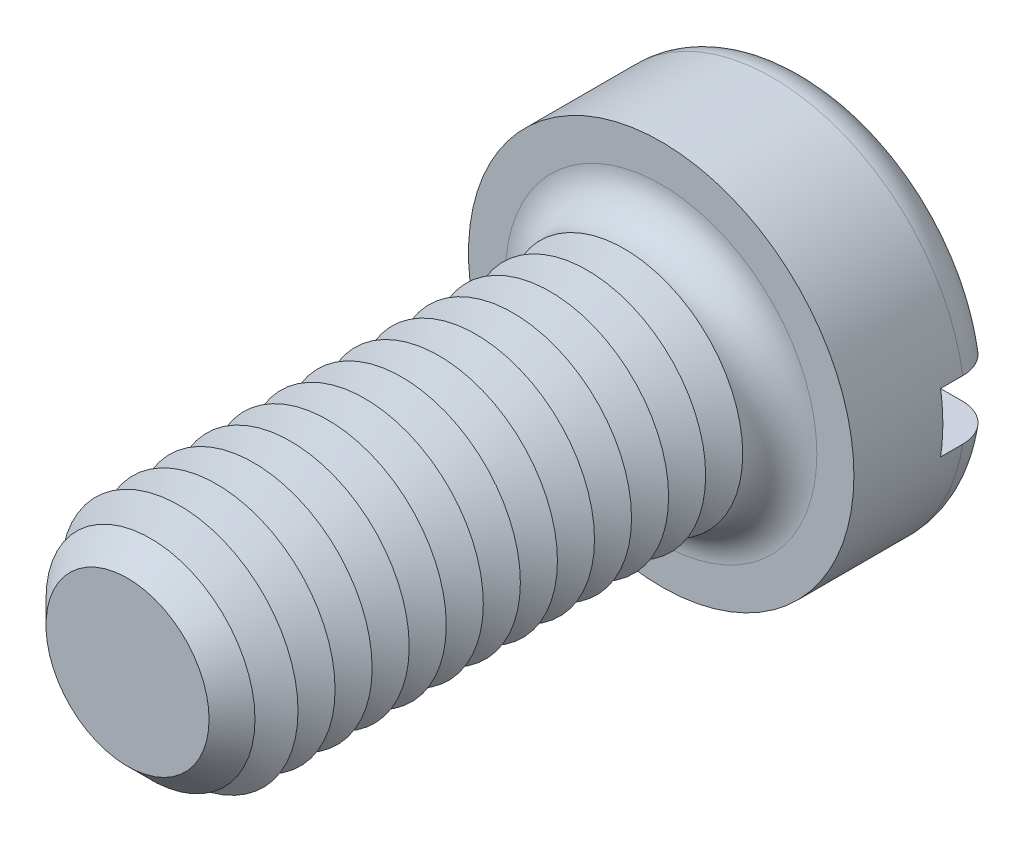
ISO-10303-21;
HEADER;
FILE_DESCRIPTION(('STEP AP214'),'2;1');
FILE_NAME('part.step','',(''),(''),'','','');
FILE_SCHEMA(('AUTOMOTIVE_DESIGN { 1 0 10303 214 1 1 1 1 }'));
ENDSEC;
DATA;
#1=APPLICATION_CONTEXT('core data for automotive mechanical design processes');
#2=APPLICATION_PROTOCOL_DEFINITION('international standard','automotive_design',2000,#1);
#3=PRODUCT_CONTEXT('',#1,'mechanical');
#4=PRODUCT('Part','Part','',(#3));
#5=PRODUCT_RELATED_PRODUCT_CATEGORY('part','',(#4));
#6=PRODUCT_DEFINITION_FORMATION('','',#4);
#7=PRODUCT_DEFINITION_CONTEXT('part definition',#1,'design');
#8=PRODUCT_DEFINITION('design','',#6,#7);
#9=PRODUCT_DEFINITION_SHAPE('','',#8);
#10=(LENGTH_UNIT() NAMED_UNIT(*) SI_UNIT(.MILLI.,.METRE.));
#11=(NAMED_UNIT(*) PLANE_ANGLE_UNIT() SI_UNIT($,.RADIAN.));
#12=(NAMED_UNIT(*) SI_UNIT($,.STERADIAN.) SOLID_ANGLE_UNIT());
#13=UNCERTAINTY_MEASURE_WITH_UNIT(LENGTH_MEASURE(1.E-05),#10,'distance_accuracy_value','');
#14=(GEOMETRIC_REPRESENTATION_CONTEXT(3) GLOBAL_UNCERTAINTY_ASSIGNED_CONTEXT((#13)) GLOBAL_UNIT_ASSIGNED_CONTEXT((#10,
#11,#12)) REPRESENTATION_CONTEXT('',''));
#15=CARTESIAN_POINT('',(0.,0.,0.));
#16=DIRECTION('',(0.,0.,1.));
#17=DIRECTION('',(1.,0.,0.));
#18=AXIS2_PLACEMENT_3D('',#15,#16,#17);
#19=CARTESIAN_POINT('',(0.,0.,-5.));
#20=DIRECTION('',(0.,0.,1.));
#21=DIRECTION('',(1.,0.,0.));
#22=AXIS2_PLACEMENT_3D('',#19,#20,#21);
#23=PLANE('',#22);
#24=CARTESIAN_POINT('',(0.,0.,-5.));
#25=DIRECTION('',(0.,0.,1.));
#26=DIRECTION('',(1.,0.,0.));
#27=AXIS2_PLACEMENT_3D('',#24,#25,#26);
#28=CIRCLE('',#27,5.25);
#29=CARTESIAN_POINT('',(-5.15388203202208,1.,-5.));
#30=VERTEX_POINT('',#29);
#31=CARTESIAN_POINT('',(5.15388203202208,1.,-5.));
#32=VERTEX_POINT('',#31);
#33=EDGE_CURVE('E116',#30,#32,#28,.F.);
#34=ORIENTED_EDGE('',*,*,#33,.T.);
#35=DIRECTION('',(1.,0.,0.));
#36=VECTOR('',#35,1.);
#37=CARTESIAN_POINT('',(-6.5,1.,-5.));
#38=LINE('',#37,#36);
#39=EDGE_CURVE('E111',#30,#32,#38,.T.);
#40=ORIENTED_EDGE('',*,*,#39,.F.);
#41=EDGE_LOOP('',(#34,#40));
#42=FACE_BOUND('',#41,.T.);
#43=ADVANCED_FACE('F39',(#42),#23,.F.);
#44=CARTESIAN_POINT('',(0.,0.,-3.75));
#45=DIRECTION('',(0.,0.,1.));
#46=DIRECTION('',(1.,0.,0.));
#47=AXIS2_PLACEMENT_3D('',#44,#45,#46);
#48=TOROIDAL_SURFACE('',#47,5.25,1.25);
#49=CARTESIAN_POINT('',(-6.04655789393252,1.,-4.63904490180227));
#50=CARTESIAN_POINT('',(-5.99546860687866,1.,-4.68885774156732));
#51=CARTESIAN_POINT('',(-5.94008472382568,1.,-4.73434760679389));
#52=CARTESIAN_POINT('',(-5.8223927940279,1.,-4.81538052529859));
#53=CARTESIAN_POINT('',(-5.7600753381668,1.,-4.85090982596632));
#54=CARTESIAN_POINT('',(-5.63044351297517,1.,-4.91100606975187));
#55=CARTESIAN_POINT('',(-5.56313479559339,1.,-4.93558519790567));
#56=CARTESIAN_POINT('',(-5.42539577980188,1.,-4.97322457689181));
#57=CARTESIAN_POINT('',(-5.35496625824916,1.,-4.98628767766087));
#58=CARTESIAN_POINT('',(-5.21212635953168,1.,-5.00070478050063));
#59=CARTESIAN_POINT('',(-5.13970265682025,1.,-5.00192674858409));
#60=CARTESIAN_POINT('',(-4.99565121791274,1.,-4.99234085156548));
#61=CARTESIAN_POINT('',(-4.92402357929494,1.,-4.98153152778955));
#62=CARTESIAN_POINT('',(-4.78274786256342,1.,-4.94801424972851));
#63=CARTESIAN_POINT('',(-4.71313137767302,1.,-4.92517296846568));
#64=CARTESIAN_POINT('',(-4.57871041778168,1.,-4.86813760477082));
#65=CARTESIAN_POINT('',(-4.51390612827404,1.,-4.83394308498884));
#66=CARTESIAN_POINT('',(-4.39095493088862,1.,-4.75508341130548));
#67=CARTESIAN_POINT('',(-4.33281197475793,1.,-4.7104120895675));
#68=CARTESIAN_POINT('',(-4.22499800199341,1.,-4.61179869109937));
#69=CARTESIAN_POINT('',(-4.17532640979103,1.,-4.55785724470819));
#70=CARTESIAN_POINT('',(-4.08677450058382,1.,-4.4431082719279));
#71=CARTESIAN_POINT('',(-4.0477350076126,1.,-4.38242369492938));
#72=CARTESIAN_POINT('',(-3.98074296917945,1.,-4.25521412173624));
#73=CARTESIAN_POINT('',(-3.95278836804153,1.,-4.18869021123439));
#74=CARTESIAN_POINT('',(-3.90959497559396,1.,-4.0537026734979));
#75=CARTESIAN_POINT('',(-3.89401985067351,1.,-3.98534663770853));
#76=CARTESIAN_POINT('',(-3.8748586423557,1.,-3.84697740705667));
#77=CARTESIAN_POINT('',(-3.87127067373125,1.,-3.7769644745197));
#78=CARTESIAN_POINT('',(-3.8761573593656,1.,-3.63892215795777));
#79=CARTESIAN_POINT('',(-3.88436651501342,1.,-3.57088319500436));
#80=CARTESIAN_POINT('',(-3.91207743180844,1.,-3.43714958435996));
#81=CARTESIAN_POINT('',(-3.93157911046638,1.,-3.37145491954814));
#82=CARTESIAN_POINT('',(-3.98125045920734,1.,-3.24411474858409));
#83=CARTESIAN_POINT('',(-4.01143761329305,1.,-3.18247607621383));
#84=CARTESIAN_POINT('',(-4.08150210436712,1.,-3.064981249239));
#85=CARTESIAN_POINT('',(-4.12138048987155,1.,-3.0091257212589));
#86=CARTESIAN_POINT('',(-4.2106718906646,1.,-2.90336353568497));
#87=CARTESIAN_POINT('',(-4.26028693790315,1.,-2.85362751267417));
#88=CARTESIAN_POINT('',(-4.36696587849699,1.,-2.76291710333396));
#89=CARTESIAN_POINT('',(-4.42403082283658,1.,-2.72194395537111));
#90=CARTESIAN_POINT('',(-4.54567957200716,1.,-2.64877280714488));
#91=CARTESIAN_POINT('',(-4.61042643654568,1.,-2.61684571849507));
#92=CARTESIAN_POINT('',(-4.74430563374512,1.,-2.56412359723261));
#93=CARTESIAN_POINT('',(-4.81343838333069,1.,-2.54332962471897));
#94=CARTESIAN_POINT('',(-4.95527237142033,1.,-2.51320471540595));
#95=CARTESIAN_POINT('',(-5.0280120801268,1.,-2.50405449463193));
#96=CARTESIAN_POINT('',(-5.17399775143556,1.,-2.49810126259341));
#97=CARTESIAN_POINT('',(-5.24724372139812,1.,-2.50129843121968));
#98=CARTESIAN_POINT('',(-5.3921014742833,1.,-2.52000776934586));
#99=CARTESIAN_POINT('',(-5.4637142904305,1.,-2.53551191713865));
#100=CARTESIAN_POINT('',(-5.60326680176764,1.,-2.57846304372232));
#101=CARTESIAN_POINT('',(-5.67120668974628,1.,-2.60590939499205));
#102=CARTESIAN_POINT('',(-5.80064060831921,1.,-2.67164926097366));
#103=CARTESIAN_POINT('',(-5.862199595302,1.,-2.7098148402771));
#104=CARTESIAN_POINT('',(-5.9779079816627,1.,-2.79608690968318));
#105=CARTESIAN_POINT('',(-6.03205795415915,1.,-2.84419263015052));
#106=CARTESIAN_POINT('',(-6.13055119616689,1.,-2.94820522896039));
#107=CARTESIAN_POINT('',(-6.17502887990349,1.,-3.00398483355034));
#108=CARTESIAN_POINT('',(-6.25384180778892,1.,-3.12230113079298));
#109=CARTESIAN_POINT('',(-6.28817779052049,1.,-3.18483733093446));
#110=CARTESIAN_POINT('',(-6.34527986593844,1.,-3.31401726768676));
#111=CARTESIAN_POINT('',(-6.36818984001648,1.,-3.38059742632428));
#112=CARTESIAN_POINT('',(-6.40240470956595,1.,-3.5166725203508));
#113=CARTESIAN_POINT('',(-6.41371067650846,1.,-3.58616718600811));
#114=CARTESIAN_POINT('',(-6.42433240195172,1.,-3.72550026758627));
#115=CARTESIAN_POINT('',(-6.4237441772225,1.,-3.79533138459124));
#116=CARTESIAN_POINT('',(-6.41082814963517,1.,-3.93391789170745));
#117=CARTESIAN_POINT('',(-6.39849757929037,1.,-4.00267302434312));
#118=CARTESIAN_POINT('',(-6.36249191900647,1.,-4.13704597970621));
#119=CARTESIAN_POINT('',(-6.33883072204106,1.,-4.20266753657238));
#120=CARTESIAN_POINT('',(-6.28088769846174,1.,-4.32897165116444));
#121=CARTESIAN_POINT('',(-6.24661890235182,1.,-4.38966015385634));
#122=CARTESIAN_POINT('',(-6.18404039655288,1.,-4.48163773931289));
#123=CARTESIAN_POINT('',(-6.15876600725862,1.,-4.51503333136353));
#124=CARTESIAN_POINT('',(-6.10500607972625,1.,-4.5791298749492));
#125=CARTESIAN_POINT('',(-6.07652056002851,1.,-4.60983084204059));
#126=CARTESIAN_POINT('',(-6.04655789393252,1.,-4.63904490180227));
#127=B_SPLINE_CURVE_WITH_KNOTS('',3,(#49,#50,#51,#52,#53,#54,#55,#56,#57,#58,#59,#60,#61,#62,
#63,#64,#65,#66,#67,#68,#69,#70,#71,#72,#73,#74,#75,#76,#77,#78,#79,#80,#81,#82,#83,#84,#85,#86,
#87,#88,#89,#90,#91,#92,#93,#94,#95,#96,#97,#98,#99,#100,#101,#102,#103,#104,#105,#106,#107,
#108,#109,#110,#111,#112,#113,#114,#115,#116,#117,#118,#119,#120,#121,#122,#123,#124,#125,#126),
.UNSPECIFIED.,.T.,.F.,(4,2,2,2,2,2,2,2,2,2,2,2,2,2,2,2,2,2,2,2,2,2,2,2,2,2,2,2,2,2,2,2,2,2,2,2,
2,2,4),(0.,0.213907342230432,0.428108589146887,0.642070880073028,0.855980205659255,
1.07227200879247,1.28859003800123,1.50735715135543,1.72613269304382,1.94503735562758,
2.16392713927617,2.37933295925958,2.59469881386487,2.80399176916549,3.01325180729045,
3.2178754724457,3.42249764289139,3.62745618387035,3.83243690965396,4.04223444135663,
4.25206160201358,4.46763253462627,4.68322399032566,4.90212226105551,5.12102372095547,
5.33978261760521,5.55853002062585,5.77477015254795,5.99099354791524,6.20398686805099,
6.41696467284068,6.62718821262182,6.83739233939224,7.0459002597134,7.25445733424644,
7.46275934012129,7.67080647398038,7.79625882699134,7.92171045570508),.UNSPECIFIED.);
#128=CARTESIAN_POINT('',(-6.42261628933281,1.,-3.74999999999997));
#129=VERTEX_POINT('',#128);
#130=EDGE_CURVE('E288',#129,#30,#127,.T.);
#131=ORIENTED_EDGE('',*,*,#130,.F.);
#132=CARTESIAN_POINT('',(0.,0.,-3.75));
#133=DIRECTION('',(0.,0.,1.));
#134=DIRECTION('',(1.,0.,0.));
#135=AXIS2_PLACEMENT_3D('',#132,#133,#134);
#136=CIRCLE('',#135,6.5);
#137=CARTESIAN_POINT('',(6.42261628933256,1.,-3.75));
#138=VERTEX_POINT('',#137);
#139=EDGE_CURVE('E124',#138,#129,#136,.T.);
#140=ORIENTED_EDGE('',*,*,#139,.F.);
#141=CARTESIAN_POINT('',(4.06944999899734,1.,-4.4133199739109));
#142=CARTESIAN_POINT('',(4.10828271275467,1.,-4.47354709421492));
#143=CARTESIAN_POINT('',(4.15233880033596,1.,-4.53047894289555));
#144=CARTESIAN_POINT('',(4.24946916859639,1.,-4.63614530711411));
#145=CARTESIAN_POINT('',(4.3025574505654,1.,-4.68486685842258));
#146=CARTESIAN_POINT('',(4.41603250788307,1.,-4.77271114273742));
#147=CARTESIAN_POINT('',(4.47640839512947,1.,-4.8118479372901));
#148=CARTESIAN_POINT('',(4.60277035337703,1.,-4.87959878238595));
#149=CARTESIAN_POINT('',(4.66875480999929,1.,-4.90821584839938));
#150=CARTESIAN_POINT('',(4.80558589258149,1.,-4.95456537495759));
#151=CARTESIAN_POINT('',(4.87649196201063,1.,-4.97212253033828));
#152=CARTESIAN_POINT('',(5.02024710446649,1.,-4.99514979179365));
#153=CARTESIAN_POINT('',(5.09309636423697,1.,-5.00061873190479));
#154=CARTESIAN_POINT('',(5.23902872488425,1.,-4.99926689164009));
#155=CARTESIAN_POINT('',(5.31211131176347,1.,-4.99238812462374));
#156=CARTESIAN_POINT('',(5.45605806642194,1.,-4.96635140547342));
#157=CARTESIAN_POINT('',(5.52692231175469,1.,-4.94719388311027));
#158=CARTESIAN_POINT('',(5.66376170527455,1.,-4.89728421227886));
#159=CARTESIAN_POINT('',(5.72977335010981,1.,-4.86663219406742));
#160=CARTESIAN_POINT('',(5.85560715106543,1.,-4.79452334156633));
#161=CARTESIAN_POINT('',(5.91542977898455,1.,-4.7530673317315));
#162=CARTESIAN_POINT('',(6.02626022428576,1.,-4.66116821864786));
#163=CARTESIAN_POINT('',(6.07738307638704,1.,-4.6108638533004));
#164=CARTESIAN_POINT('',(6.17030947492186,1.,-4.50227823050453));
#165=CARTESIAN_POINT('',(6.2121137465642,1.,-4.44399759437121));
#166=CARTESIAN_POINT('',(6.28460268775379,1.,-4.32200305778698));
#167=CARTESIAN_POINT('',(6.31543589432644,1.,-4.2583773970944));
#168=CARTESIAN_POINT('',(6.36586009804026,1.,-4.12681721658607));
#169=CARTESIAN_POINT('',(6.38545178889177,1.,-4.0588829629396));
#170=CARTESIAN_POINT('',(6.41265760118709,1.,-3.92136007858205));
#171=CARTESIAN_POINT('',(6.42038873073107,1.,-3.85179457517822));
#172=CARTESIAN_POINT('',(6.42401070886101,1.,-3.7123569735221));
#173=CARTESIAN_POINT('',(6.41990193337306,1.,-3.64248488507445));
#174=CARTESIAN_POINT('',(6.40000894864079,1.,-3.50470871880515));
#175=CARTESIAN_POINT('',(6.38427119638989,1.,-3.43679792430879));
#176=CARTESIAN_POINT('',(6.34164491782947,1.,-3.30457296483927));
#177=CARTESIAN_POINT('',(6.31475638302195,1.,-3.24025880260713));
#178=CARTESIAN_POINT('',(6.2505455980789,1.,-3.11686791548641));
#179=CARTESIAN_POINT('',(6.21319759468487,1.,-3.05780459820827));
#180=CARTESIAN_POINT('',(6.12919411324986,1.,-2.94671919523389));
#181=CARTESIAN_POINT('',(6.08253833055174,1.,-2.89469734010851));
#182=CARTESIAN_POINT('',(5.98083387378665,1.,-2.79868150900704));
#183=CARTESIAN_POINT('',(5.92571704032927,1.,-2.75475975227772));
#184=CARTESIAN_POINT('',(5.80897194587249,1.,-2.67665277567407));
#185=CARTESIAN_POINT('',(5.74734329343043,1.,-2.64246814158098));
#186=CARTESIAN_POINT('',(5.6184644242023,1.,-2.58431810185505));
#187=CARTESIAN_POINT('',(5.55115102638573,1.,-2.56049275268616));
#188=CARTESIAN_POINT('',(5.41351272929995,1.,-2.52429868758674));
#189=CARTESIAN_POINT('',(5.34318759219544,1.,-2.51193087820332));
#190=CARTESIAN_POINT('',(5.20041507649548,1.,-2.49882112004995));
#191=CARTESIAN_POINT('',(5.12795169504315,1.,-2.49825332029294));
#192=CARTESIAN_POINT('',(4.98393373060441,1.,-2.50914771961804));
#193=CARTESIAN_POINT('',(4.91237921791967,1.,-2.52061084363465));
#194=CARTESIAN_POINT('',(4.77137358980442,1.,-2.55542281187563));
#195=CARTESIAN_POINT('',(4.70195472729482,1.,-2.57890245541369));
#196=CARTESIAN_POINT('',(4.56803538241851,1.,-2.63717701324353));
#197=CARTESIAN_POINT('',(4.50353509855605,1.,-2.67197238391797));
#198=CARTESIAN_POINT('',(4.38131858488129,1.,-2.7519648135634));
#199=CARTESIAN_POINT('',(4.32360365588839,1.,-2.79716386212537));
#200=CARTESIAN_POINT('',(4.21673400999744,1.,-2.89675634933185));
#201=CARTESIAN_POINT('',(4.16757871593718,1.,-2.95114916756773));
#202=CARTESIAN_POINT('',(4.08014713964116,1.,-3.06667703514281));
#203=CARTESIAN_POINT('',(4.04170608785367,1.,-3.12768727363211));
#204=CARTESIAN_POINT('',(3.97596192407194,1.,-3.25543782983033));
#205=CARTESIAN_POINT('',(3.94865624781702,1.,-3.32217682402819));
#206=CARTESIAN_POINT('',(3.9067737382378,1.,-3.45745603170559));
#207=CARTESIAN_POINT('',(3.89185707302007,1.,-3.52589108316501));
#208=CARTESIAN_POINT('',(3.87400755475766,1.,-3.66432360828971));
#209=CARTESIAN_POINT('',(3.87107601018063,1.,-3.73432125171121));
#210=CARTESIAN_POINT('',(3.8772387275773,1.,-3.87228267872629));
#211=CARTESIAN_POINT('',(3.88607933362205,1.,-3.94025811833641));
#212=CARTESIAN_POINT('',(3.91502769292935,1.,-4.07370133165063));
#213=CARTESIAN_POINT('',(3.93512131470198,1.,-4.1391721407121));
#214=CARTESIAN_POINT('',(3.9752037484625,1.,-4.23926719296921));
#215=CARTESIAN_POINT('',(3.99171171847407,1.,-4.27532618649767));
#216=CARTESIAN_POINT('',(4.02809737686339,1.,-4.34569933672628));
#217=CARTESIAN_POINT('',(4.04797497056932,1.,-4.3800135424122));
#218=CARTESIAN_POINT('',(4.06944999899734,1.,-4.4133199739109));
#219=B_SPLINE_CURVE_WITH_KNOTS('',3,(#141,#142,#143,#144,#145,#146,#147,#148,#149,#150,#151,
#152,#153,#154,#155,#156,#157,#158,#159,#160,#161,#162,#163,#164,#165,#166,#167,#168,#169,#170,
#171,#172,#173,#174,#175,#176,#177,#178,#179,#180,#181,#182,#183,#184,#185,#186,#187,#188,#189,
#190,#191,#192,#193,#194,#195,#196,#197,#198,#199,#200,#201,#202,#203,#204,#205,#206,#207,#208,
#209,#210,#211,#212,#213,#214,#215,#216,#217,#218),.UNSPECIFIED.,.T.,.F.,(4,2,2,2,2,2,2,2,2,2,2,
2,2,2,2,2,2,2,2,2,2,2,2,2,2,2,2,2,2,2,2,2,2,2,2,2,2,2,4),(0.,0.214833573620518,
0.430003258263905,0.644855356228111,0.859645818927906,1.0777603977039,1.29589601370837,
1.51505870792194,1.73421373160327,1.95150241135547,2.16877451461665,2.38290237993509,
2.59701357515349,2.8081044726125,3.01918234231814,3.22816416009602,3.43713934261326,
3.64528416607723,3.85342914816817,4.06209119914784,4.27076008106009,4.48120788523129,
4.69166834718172,4.90489186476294,5.11813225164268,5.33451752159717,5.55091942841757,
5.76972860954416,5.98854661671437,6.20740650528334,6.42625163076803,6.64151774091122,
6.85673425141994,7.0658317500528,7.27495207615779,7.47963858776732,7.68406862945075,
7.80287790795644,7.92168384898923),.UNSPECIFIED.);
#220=EDGE_CURVE('E290',#32,#138,#219,.T.);
#221=ORIENTED_EDGE('',*,*,#220,.F.);
#222=ORIENTED_EDGE('',*,*,#33,.F.);
#223=EDGE_LOOP('',(#131,#140,#221,#222));
#224=FACE_BOUND('',#223,.T.);
#225=ADVANCED_FACE('F272',(#224),#48,.T.);
#226=CARTESIAN_POINT('',(0.,0.,-5.));
#227=DIRECTION('',(0.,0.,1.));
#228=DIRECTION('',(1.,0.,0.));
#229=AXIS2_PLACEMENT_3D('',#226,#227,#228);
#230=CYLINDRICAL_SURFACE('',#229,6.5);
#231=DIRECTION('',(0.,0.,1.));
#232=VECTOR('',#231,1.);
#233=CARTESIAN_POINT('',(6.42261628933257,1.,-5.));
#234=LINE('',#233,#232);
#235=CARTESIAN_POINT('',(6.42261628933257,1.,-3.));
#236=VERTEX_POINT('',#235);
#237=EDGE_CURVE('E306',#138,#236,#234,.T.);
#238=ORIENTED_EDGE('',*,*,#237,.F.);
#239=ORIENTED_EDGE('',*,*,#139,.T.);
#240=DIRECTION('',(0.,0.,1.));
#241=VECTOR('',#240,1.);
#242=CARTESIAN_POINT('',(-6.42261628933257,1.,-5.));
#243=LINE('',#242,#241);
#244=CARTESIAN_POINT('',(-6.42261628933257,1.,-3.));
#245=VERTEX_POINT('',#244);
#246=EDGE_CURVE('E63',#245,#129,#243,.F.);
#247=ORIENTED_EDGE('',*,*,#246,.F.);
#248=CARTESIAN_POINT('',(0.,0.,-3.));
#249=DIRECTION('',(0.,0.,-1.));
#250=DIRECTION('',(-1.,0.,0.));
#251=AXIS2_PLACEMENT_3D('',#248,#249,#250);
#252=CIRCLE('',#251,6.5);
#253=CARTESIAN_POINT('',(-6.42261628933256,-0.999999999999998,-3.));
#254=VERTEX_POINT('',#253);
#255=EDGE_CURVE('E43',#245,#254,#252,.F.);
#256=ORIENTED_EDGE('',*,*,#255,.T.);
#257=DIRECTION('',(0.,0.,1.));
#258=VECTOR('',#257,1.);
#259=CARTESIAN_POINT('',(-6.42261628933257,-0.999999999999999,-5.));
#260=LINE('',#259,#258);
#261=CARTESIAN_POINT('',(-6.42261628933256,-0.999999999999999,-3.75));
#262=VERTEX_POINT('',#261);
#263=EDGE_CURVE('E303',#262,#254,#260,.T.);
#264=ORIENTED_EDGE('',*,*,#263,.F.);
#265=CARTESIAN_POINT('',(6.42261628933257,-1.,-3.75));
#266=VERTEX_POINT('',#265);
#267=EDGE_CURVE('E126',#262,#266,#136,.T.);
#268=ORIENTED_EDGE('',*,*,#267,.T.);
#269=DIRECTION('',(0.,0.,1.));
#270=VECTOR('',#269,1.);
#271=CARTESIAN_POINT('',(6.42261628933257,-1.,-5.));
#272=LINE('',#271,#270);
#273=CARTESIAN_POINT('',(6.42261628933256,-1.,-3.));
#274=VERTEX_POINT('',#273);
#275=EDGE_CURVE('E55',#274,#266,#272,.F.);
#276=ORIENTED_EDGE('',*,*,#275,.F.);
#277=EDGE_CURVE('E11',#274,#236,#252,.F.);
#278=ORIENTED_EDGE('',*,*,#277,.T.);
#279=EDGE_LOOP('',(#238,#239,#247,#256,#264,#268,#276,#278));
#280=FACE_BOUND('',#279,.T.);
#281=CARTESIAN_POINT('',(0.,0.,0.));
#282=DIRECTION('',(0.,0.,1.));
#283=DIRECTION('',(1.,0.,0.));
#284=AXIS2_PLACEMENT_3D('',#281,#282,#283);
#285=CIRCLE('',#284,6.5);
#286=CARTESIAN_POINT('',(6.5,0.,0.));
#287=VERTEX_POINT('',#286);
#288=EDGE_CURVE('E309',#287,#287,#285,.T.);
#289=ORIENTED_EDGE('',*,*,#288,.F.);
#290=EDGE_LOOP('',(#289));
#291=FACE_BOUND('',#290,.T.);
#292=ADVANCED_FACE('F268',(#280,#291),#230,.T.);
#293=CARTESIAN_POINT('',(5.15388203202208,-1.,-5.));
#294=VERTEX_POINT('',#293);
#295=CARTESIAN_POINT('',(-5.15388203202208,-0.999999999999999,-5.));
#296=VERTEX_POINT('',#295);
#297=EDGE_CURVE('E109',#294,#296,#28,.F.);
#298=ORIENTED_EDGE('',*,*,#297,.T.);
#299=DIRECTION('',(-1.,0.,0.));
#300=VECTOR('',#299,1.);
#301=CARTESIAN_POINT('',(-6.5,-0.999999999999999,-5.));
#302=LINE('',#301,#300);
#303=EDGE_CURVE('E96',#294,#296,#302,.T.);
#304=ORIENTED_EDGE('',*,*,#303,.F.);
#305=EDGE_LOOP('',(#298,#304));
#306=FACE_BOUND('',#305,.T.);
#307=ADVANCED_FACE('F108',(#306),#23,.F.);
#308=CARTESIAN_POINT('',(0.,0.,0.));
#309=DIRECTION('',(0.,0.,1.));
#310=DIRECTION('',(1.,0.,0.));
#311=AXIS2_PLACEMENT_3D('',#308,#309,#310);
#312=PLANE('',#311);
#313=CARTESIAN_POINT('',(0.,0.,0.));
#314=DIRECTION('',(0.,0.,1.));
#315=DIRECTION('',(1.,0.,0.));
#316=AXIS2_PLACEMENT_3D('',#313,#314,#315);
#317=CIRCLE('',#316,5.25);
#318=CARTESIAN_POINT('',(5.25,0.,0.));
#319=VERTEX_POINT('',#318);
#320=EDGE_CURVE('E115',#319,#319,#317,.F.);
#321=ORIENTED_EDGE('',*,*,#320,.T.);
#322=EDGE_LOOP('',(#321));
#323=FACE_BOUND('',#322,.T.);
#324=ORIENTED_EDGE('',*,*,#288,.T.);
#325=EDGE_LOOP('',(#324));
#326=FACE_BOUND('',#325,.T.);
#327=ADVANCED_FACE('F267',(#323,#326),#312,.T.);
#328=CARTESIAN_POINT('',(-6.04655789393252,-0.999999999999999,-4.63904490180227));
#329=CARTESIAN_POINT('',(-6.0966604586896,-0.999999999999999,-4.59018532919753));
#330=CARTESIAN_POINT('',(-6.14270501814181,-0.999999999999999,-4.53709744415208));
#331=CARTESIAN_POINT('',(-6.22528519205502,-0.999999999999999,-4.42391631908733));
#332=CARTESIAN_POINT('',(-6.26181074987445,-0.999999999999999,-4.36381576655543));
#333=CARTESIAN_POINT('',(-6.32422109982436,-0.999999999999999,-4.23831836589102));
#334=CARTESIAN_POINT('',(-6.35010658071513,-0.999999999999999,-4.17292186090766));
#335=CARTESIAN_POINT('',(-6.39044668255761,-0.999999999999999,-4.03870925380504));
#336=CARTESIAN_POINT('',(-6.40490396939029,-0.999999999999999,-3.96989395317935));
#337=CARTESIAN_POINT('',(-6.42190814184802,-0.999999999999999,-3.83122595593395));
#338=CARTESIAN_POINT('',(-6.4245257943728,-0.999999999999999,-3.76138193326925));
#339=CARTESIAN_POINT('',(-6.41796432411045,-0.999999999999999,-3.62224935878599));
#340=CARTESIAN_POINT('',(-6.40878509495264,-0.999999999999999,-3.55296081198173));
#341=CARTESIAN_POINT('',(-6.37894560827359,-0.999999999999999,-3.41709241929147));
#342=CARTESIAN_POINT('',(-6.35831520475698,-0.999999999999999,-3.35050601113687));
#343=CARTESIAN_POINT('',(-6.30620980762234,-0.999999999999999,-3.22172312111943));
#344=CARTESIAN_POINT('',(-6.2747347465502,-0.999999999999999,-3.15952666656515));
#345=CARTESIAN_POINT('',(-6.20172710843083,-0.999999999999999,-3.04101762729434));
#346=CARTESIAN_POINT('',(-6.16015622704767,-0.999999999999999,-2.98472864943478));
#347=CARTESIAN_POINT('',(-6.06823774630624,-0.999999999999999,-2.87984578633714));
#348=CARTESIAN_POINT('',(-6.01788981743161,-0.999999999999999,-2.83125219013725));
#349=CARTESIAN_POINT('',(-5.90933830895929,-0.999999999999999,-2.74262118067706));
#350=CARTESIAN_POINT('',(-5.85106338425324,-0.999999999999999,-2.70267117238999));
#351=CARTESIAN_POINT('',(-5.72870702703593,-0.999999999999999,-2.63296796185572));
#352=CARTESIAN_POINT('',(-5.66462521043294,-0.999999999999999,-2.6032154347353));
#353=CARTESIAN_POINT('',(-5.53153273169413,-0.999999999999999,-2.55430842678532));
#354=CARTESIAN_POINT('',(-5.46246626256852,-0.999999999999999,-2.53530583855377));
#355=CARTESIAN_POINT('',(-5.32214267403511,-0.999999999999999,-2.5089831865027));
#356=CARTESIAN_POINT('',(-5.25088537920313,-0.999999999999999,-2.50166406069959));
#357=CARTESIAN_POINT('',(-5.10710123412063,-0.999999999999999,-2.49882202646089));
#358=CARTESIAN_POINT('',(-5.03457095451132,-0.999999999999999,-2.50347166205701));
#359=CARTESIAN_POINT('',(-4.8912897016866,-0.999999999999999,-2.52476029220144));
#360=CARTESIAN_POINT('',(-4.82053886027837,-0.999999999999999,-2.54140017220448));
#361=CARTESIAN_POINT('',(-4.68213257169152,-0.999999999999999,-2.58641614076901));
#362=CARTESIAN_POINT('',(-4.61451256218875,-0.999999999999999,-2.61490131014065));
#363=CARTESIAN_POINT('',(-4.48502801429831,-0.999999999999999,-2.68285095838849));
#364=CARTESIAN_POINT('',(-4.42316359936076,-0.999999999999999,-2.72231567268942));
#365=CARTESIAN_POINT('',(-4.30720694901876,-0.999999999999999,-2.81103994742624));
#366=CARTESIAN_POINT('',(-4.25309118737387,-0.999999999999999,-2.86026872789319));
#367=CARTESIAN_POINT('',(-4.15409408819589,-0.999999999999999,-2.9672764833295));
#368=CARTESIAN_POINT('',(-4.10921182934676,-0.999999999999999,-3.02505460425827));
#369=CARTESIAN_POINT('',(-4.03096584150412,-0.999999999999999,-3.14632492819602));
#370=CARTESIAN_POINT('',(-3.99739097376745,-0.999999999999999,-3.2096807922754));
#371=CARTESIAN_POINT('',(-3.94171839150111,-0.999999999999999,-3.34124912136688));
#372=CARTESIAN_POINT('',(-3.91961840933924,-0.999999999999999,-3.40946062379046));
#373=CARTESIAN_POINT('',(-3.88816636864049,-0.999999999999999,-3.54669256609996));
#374=CARTESIAN_POINT('',(-3.87846562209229,-0.999999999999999,-3.61563318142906));
#375=CARTESIAN_POINT('',(-3.87100568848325,-0.999999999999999,-3.75415397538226));
#376=CARTESIAN_POINT('',(-3.87324501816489,-0.999999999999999,-3.82373407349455));
#377=CARTESIAN_POINT('',(-3.88943589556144,-0.999999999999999,-3.96027701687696));
#378=CARTESIAN_POINT('',(-3.90318225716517,-0.999999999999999,-4.0272643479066));
#379=CARTESIAN_POINT('',(-3.94163954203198,-0.999999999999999,-4.1580093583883));
#380=CARTESIAN_POINT('',(-3.96635075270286,-0.999999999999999,-4.22176695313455));
#381=CARTESIAN_POINT('',(-4.026160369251,-0.999999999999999,-4.34483320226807));
#382=CARTESIAN_POINT('',(-4.06134035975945,-0.999999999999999,-4.40410214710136));
#383=CARTESIAN_POINT('',(-4.14090865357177,-0.999999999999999,-4.51609417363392));
#384=CARTESIAN_POINT('',(-4.18529811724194,-0.999999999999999,-4.56881642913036));
#385=CARTESIAN_POINT('',(-4.2832649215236,-0.999999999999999,-4.66770177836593));
#386=CARTESIAN_POINT('',(-4.33705327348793,-0.999999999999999,-4.71365579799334));
#387=CARTESIAN_POINT('',(-4.45141776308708,-0.999999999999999,-4.79615385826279));
#388=CARTESIAN_POINT('',(-4.51199483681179,-0.999999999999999,-4.83269659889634));
#389=CARTESIAN_POINT('',(-4.63989216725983,-0.999999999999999,-4.89626962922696));
#390=CARTESIAN_POINT('',(-4.70734508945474,-0.999999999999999,-4.92303326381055));
#391=CARTESIAN_POINT('',(-4.84575497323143,-0.999999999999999,-4.96500199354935));
#392=CARTESIAN_POINT('',(-4.91671207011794,-0.999999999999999,-4.98020664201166));
#393=CARTESIAN_POINT('',(-5.06097761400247,-0.999999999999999,-4.9987306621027));
#394=CARTESIAN_POINT('',(-5.13430353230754,-0.999999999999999,-5.00191441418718));
#395=CARTESIAN_POINT('',(-5.28046546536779,-0.999999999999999,-4.99587686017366));
#396=CARTESIAN_POINT('',(-5.35330135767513,-0.999999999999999,-4.98665256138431));
#397=CARTESIAN_POINT('',(-5.49610354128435,-0.999999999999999,-4.95604184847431));
#398=CARTESIAN_POINT('',(-5.56607890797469,-0.999999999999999,-4.93469772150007));
#399=CARTESIAN_POINT('',(-5.70131538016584,-0.999999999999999,-4.88041956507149));
#400=CARTESIAN_POINT('',(-5.76658233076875,-0.999999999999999,-4.84750021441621));
#401=CARTESIAN_POINT('',(-5.86782577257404,-0.999999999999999,-4.78498748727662));
#402=CARTESIAN_POINT('',(-5.90579749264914,-0.999999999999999,-4.75856648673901));
#403=CARTESIAN_POINT('',(-5.97862186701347,-0.999999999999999,-4.70172646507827));
#404=CARTESIAN_POINT('',(-6.0134745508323,-0.999999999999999,-4.6713074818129));
#405=CARTESIAN_POINT('',(-6.04655789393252,-0.999999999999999,-4.63904490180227));
#406=B_SPLINE_CURVE_WITH_KNOTS('',3,(#328,#329,#330,#331,#332,#333,#334,#335,#336,#337,#338,
#339,#340,#341,#342,#343,#344,#345,#346,#347,#348,#349,#350,#351,#352,#353,#354,#355,#356,#357,
#358,#359,#360,#361,#362,#363,#364,#365,#366,#367,#368,#369,#370,#371,#372,#373,#374,#375,#376,
#377,#378,#379,#380,#381,#382,#383,#384,#385,#386,#387,#388,#389,#390,#391,#392,#393,#394,#395,
#396,#397,#398,#399,#400,#401,#402,#403,#404,#405),.UNSPECIFIED.,.T.,.F.,(4,2,2,2,2,2,2,2,2,2,2,
2,2,2,2,2,2,2,2,2,2,2,2,2,2,2,2,2,2,2,2,2,2,2,2,2,2,2,4),(0.,0.209780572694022,
0.419781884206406,0.629769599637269,0.839708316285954,1.04839053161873,1.2570746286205,
1.46521720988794,1.67336108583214,1.88230736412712,2.09126148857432,2.30223890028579,
2.51323027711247,2.72713284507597,2.94105258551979,3.15807345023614,3.37511034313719,
3.59419176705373,3.81327788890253,4.03168404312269,4.25006839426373,4.46411376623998,
4.67811682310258,4.88595885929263,5.09377507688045,5.29796268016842,5.50215563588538,
5.70798353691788,5.91383738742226,6.12510741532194,6.33640661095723,6.55309998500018,
6.76980173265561,6.98894112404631,7.20813337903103,7.42656551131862,7.64472163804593,
7.78324365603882,7.92176436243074),.UNSPECIFIED.);
#407=EDGE_CURVE('E103',#296,#262,#406,.T.);
#408=ORIENTED_EDGE('',*,*,#407,.F.);
#409=ORIENTED_EDGE('',*,*,#297,.F.);
#410=CARTESIAN_POINT('',(4.06944999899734,-1.,-4.4133199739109));
#411=CARTESIAN_POINT('',(4.03213207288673,-1.,-4.3554312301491));
#412=CARTESIAN_POINT('',(3.9995849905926,-1.,-4.29441722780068));
#413=CARTESIAN_POINT('',(3.94511822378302,-1.,-4.16776604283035));
#414=CARTESIAN_POINT('',(3.92320762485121,-1.,-4.10212496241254));
#415=CARTESIAN_POINT('',(3.89078811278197,-1.,-3.96804412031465));
#416=CARTESIAN_POINT('',(3.88028409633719,-1.,-3.89960316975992));
#417=CARTESIAN_POINT('',(3.87107895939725,-1.,-3.76194650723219));
#418=CARTESIAN_POINT('',(3.87237511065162,-1.,-3.69273097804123));
#419=CARTESIAN_POINT('',(3.88662927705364,-1.,-3.55634460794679));
#420=CARTESIAN_POINT('',(3.89944923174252,-1.,-3.48915926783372));
#421=CARTESIAN_POINT('',(3.93611188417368,-1.,-3.35786953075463));
#422=CARTESIAN_POINT('',(3.95995518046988,-1.,-3.29376530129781));
#423=CARTESIAN_POINT('',(4.0180748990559,-1.,-3.16993562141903));
#424=CARTESIAN_POINT('',(4.05242297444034,-1.,-3.11024385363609));
#425=CARTESIAN_POINT('',(4.13041121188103,-1.,-2.9972793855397));
#426=CARTESIAN_POINT('',(4.17405248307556,-1.,-2.94400745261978));
#427=CARTESIAN_POINT('',(4.27058636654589,-1.,-2.8439150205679));
#428=CARTESIAN_POINT('',(4.32368948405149,-1.,-2.79729757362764));
#429=CARTESIAN_POINT('',(4.43679856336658,-1.,-2.71336600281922));
#430=CARTESIAN_POINT('',(4.49680546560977,-1.,-2.67605314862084));
#431=CARTESIAN_POINT('',(4.62370121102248,-1.,-2.61081752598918));
#432=CARTESIAN_POINT('',(4.69072799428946,-1.,-2.58316284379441));
#433=CARTESIAN_POINT('',(4.82843981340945,-1.,-2.5393441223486));
#434=CARTESIAN_POINT('',(4.899125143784,-1.,-2.52318100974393));
#435=CARTESIAN_POINT('',(5.04306377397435,-1.,-2.50267755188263));
#436=CARTESIAN_POINT('',(5.11633773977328,-1.,-2.49848181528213));
#437=CARTESIAN_POINT('',(5.26254809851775,-1.,-2.50249357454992));
#438=CARTESIAN_POINT('',(5.33548449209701,-1.,-2.51070104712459));
#439=CARTESIAN_POINT('',(5.4786703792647,-1.,-2.53930888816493));
#440=CARTESIAN_POINT('',(5.54892819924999,-1.,-2.5596675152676));
#441=CARTESIAN_POINT('',(5.68495799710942,-1.,-2.61204238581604));
#442=CARTESIAN_POINT('',(5.75073024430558,-1.,-2.64405792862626));
#443=CARTESIAN_POINT('',(5.8750178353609,-1.,-2.7184150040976));
#444=CARTESIAN_POINT('',(5.93361487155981,-1.,-2.76061995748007));
#445=CARTESIAN_POINT('',(6.04275377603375,-1.,-2.85440601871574));
#446=CARTESIAN_POINT('',(6.09329629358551,-1.,-2.90598637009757));
#447=CARTESIAN_POINT('',(6.18409572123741,-1.,-3.01622977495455));
#448=CARTESIAN_POINT('',(6.2244945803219,-1.,-3.07477592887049));
#449=CARTESIAN_POINT('',(6.29474798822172,-1.,-3.19788594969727));
#450=CARTESIAN_POINT('',(6.3246032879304,-1.,-3.26244938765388));
#451=CARTESIAN_POINT('',(6.37256001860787,-1.,-3.39491634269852));
#452=CARTESIAN_POINT('',(6.39079949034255,-1.,-3.46276990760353));
#453=CARTESIAN_POINT('',(6.41554133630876,-1.,-3.60058363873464));
#454=CARTESIAN_POINT('',(6.42204424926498,-1.,-3.67054370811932));
#455=CARTESIAN_POINT('',(6.42311237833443,-1.,-3.81007982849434));
#456=CARTESIAN_POINT('',(6.41775799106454,-1.,-3.879655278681));
#457=CARTESIAN_POINT('',(6.39543799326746,-1.,-4.01691664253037));
#458=CARTESIAN_POINT('',(6.3784725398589,-1.,-4.08460258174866));
#459=CARTESIAN_POINT('',(6.33344768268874,-1.,-4.21614537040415));
#460=CARTESIAN_POINT('',(6.30539273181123,-1.,-4.28000374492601));
#461=CARTESIAN_POINT('',(6.23902076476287,-1.,-4.40214140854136));
#462=CARTESIAN_POINT('',(6.20070356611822,-1.,-4.46042059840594));
#463=CARTESIAN_POINT('',(6.11467174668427,-1.,-4.5701315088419));
#464=CARTESIAN_POINT('',(6.06690270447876,-1.,-4.62152053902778));
#465=CARTESIAN_POINT('',(5.96350111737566,-1.,-4.715657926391));
#466=CARTESIAN_POINT('',(5.90786817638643,-1.,-4.75840584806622));
#467=CARTESIAN_POINT('',(5.78965380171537,-1.,-4.8345781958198));
#468=CARTESIAN_POINT('',(5.72700078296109,-1.,-4.86789149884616));
#469=CARTESIAN_POINT('',(5.59704977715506,-1.,-4.92369754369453));
#470=CARTESIAN_POINT('',(5.52975144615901,-1.,-4.94618948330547));
#471=CARTESIAN_POINT('',(5.39137621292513,-1.,-4.98006173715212));
#472=CARTESIAN_POINT('',(5.32025859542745,-1.,-4.99127571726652));
#473=CARTESIAN_POINT('',(5.17715081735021,-1.,-5.00177798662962));
#474=CARTESIAN_POINT('',(5.10516061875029,-1.,-5.00106575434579));
#475=CARTESIAN_POINT('',(4.96131924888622,-1.,-4.98769775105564));
#476=CARTESIAN_POINT('',(4.88948297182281,-1.,-4.97488146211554));
#477=CARTESIAN_POINT('',(4.74893184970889,-1.,-4.93744335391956));
#478=CARTESIAN_POINT('',(4.68021795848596,-1.,-4.91281795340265));
#479=CARTESIAN_POINT('',(4.54744428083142,-1.,-4.8522329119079));
#480=CARTESIAN_POINT('',(4.48341761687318,-1.,-4.81620070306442));
#481=CARTESIAN_POINT('',(4.36244497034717,-1.,-4.73383277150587));
#482=CARTESIAN_POINT('',(4.30549069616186,-1.,-4.68750929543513));
#483=CARTESIAN_POINT('',(4.21823158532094,-1.,-4.60311228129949));
#484=CARTESIAN_POINT('',(4.18544074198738,-1.,-4.56757118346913));
#485=CARTESIAN_POINT('',(4.12413461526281,-1.,-4.49297229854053));
#486=CARTESIAN_POINT('',(4.09561926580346,-1.,-4.45391456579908));
#487=CARTESIAN_POINT('',(4.06944999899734,-1.,-4.4133199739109));
#488=B_SPLINE_CURVE_WITH_KNOTS('',3,(#410,#411,#412,#413,#414,#415,#416,#417,#418,#419,#420,
#421,#422,#423,#424,#425,#426,#427,#428,#429,#430,#431,#432,#433,#434,#435,#436,#437,#438,#439,
#440,#441,#442,#443,#444,#445,#446,#447,#448,#449,#450,#451,#452,#453,#454,#455,#456,#457,#458,
#459,#460,#461,#462,#463,#464,#465,#466,#467,#468,#469,#470,#471,#472,#473,#474,#475,#476,#477,
#478,#479,#480,#481,#482,#483,#484,#485,#486,#487),.UNSPECIFIED.,.T.,.F.,(4,2,2,2,2,2,2,2,2,2,2,
2,2,2,2,2,2,2,2,2,2,2,2,2,2,2,2,2,2,2,2,2,2,2,2,2,2,2,4),(0.,0.206453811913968,0.4130836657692,
0.619802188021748,0.826472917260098,1.03070015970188,1.23493849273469,1.44060223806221,
1.64629054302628,1.85731119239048,2.06836062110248,2.28487349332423,2.5014038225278,
2.72053974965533,2.9396752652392,3.15806230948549,3.37643622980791,3.59203140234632,
3.80760918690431,4.01997696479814,4.23232961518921,4.44210913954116,4.65187903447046,
4.86023097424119,5.06858009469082,5.27684563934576,5.48511488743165,5.69462015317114,
5.90413597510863,6.11602561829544,6.32793096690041,6.54291770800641,6.75791385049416,
6.97580180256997,7.19375587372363,7.41312537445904,7.63223520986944,7.77701357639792,
7.92178970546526),.UNSPECIFIED.);
#489=EDGE_CURVE('E92',#266,#294,#488,.T.);
#490=ORIENTED_EDGE('',*,*,#489,.F.);
#491=ORIENTED_EDGE('',*,*,#267,.F.);
#492=EDGE_LOOP('',(#408,#409,#490,#491));
#493=FACE_BOUND('',#492,.T.);
#494=ADVANCED_FACE('F113',(#493),#48,.T.);
#495=CARTESIAN_POINT('',(0.,0.,1.25));
#496=DIRECTION('',(0.,0.,1.));
#497=DIRECTION('',(1.,0.,0.));
#498=AXIS2_PLACEMENT_3D('',#495,#496,#497);
#499=TOROIDAL_SURFACE('',#498,5.25,1.25);
#500=ORIENTED_EDGE('',*,*,#320,.F.);
#501=EDGE_LOOP('',(#500));
#502=FACE_BOUND('',#501,.T.);
#503=CARTESIAN_POINT('',(0.,0.,1.25));
#504=DIRECTION('',(0.,0.,-1.));
#505=DIRECTION('',(-1.,0.,0.));
#506=AXIS2_PLACEMENT_3D('',#503,#504,#505);
#507=CIRCLE('',#506,4.);
#508=CARTESIAN_POINT('',(-4.,0.,1.25));
#509=VERTEX_POINT('',#508);
#510=EDGE_CURVE('E313',#509,#509,#507,.T.);
#511=ORIENTED_EDGE('',*,*,#510,.T.);
#512=EDGE_LOOP('',(#511));
#513=FACE_BOUND('',#512,.T.);
#514=ADVANCED_FACE('F260',(#502,#513),#499,.F.);
#515=CARTESIAN_POINT('',(0.,0.,1.875));
#516=DIRECTION('',(0.,0.,-1.));
#517=DIRECTION('',(-1.,0.,0.));
#518=AXIS2_PLACEMENT_3D('',#515,#516,#517);
#519=CONICAL_SURFACE('',#518,2.91746824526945,1.0471975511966);
#520=ORIENTED_EDGE('',*,*,#510,.F.);
#521=EDGE_LOOP('',(#520));
#522=FACE_BOUND('',#521,.T.);
#523=CARTESIAN_POINT('',(0.,0.,1.875));
#524=DIRECTION('',(0.,0.,-1.));
#525=DIRECTION('',(-1.,0.,0.));
#526=AXIS2_PLACEMENT_3D('',#523,#524,#525);
#527=CIRCLE('',#526,2.91746824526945);
#528=CARTESIAN_POINT('',(-2.91746824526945,0.,1.875));
#529=VERTEX_POINT('',#528);
#530=EDGE_CURVE('E319',#529,#529,#527,.T.);
#531=ORIENTED_EDGE('',*,*,#530,.T.);
#532=EDGE_LOOP('',(#531));
#533=FACE_BOUND('',#532,.T.);
#534=ADVANCED_FACE('F256',(#522,#533),#519,.T.);
#535=CARTESIAN_POINT('',(0.,0.,2.5));
#536=DIRECTION('',(0.,0.,1.));
#537=DIRECTION('',(1.,0.,0.));
#538=AXIS2_PLACEMENT_3D('',#535,#536,#537);
#539=CONICAL_SURFACE('',#538,4.,1.0471975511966);
#540=ORIENTED_EDGE('',*,*,#530,.F.);
#541=EDGE_LOOP('',(#540));
#542=FACE_BOUND('',#541,.T.);
#543=CARTESIAN_POINT('',(0.,0.,2.5));
#544=DIRECTION('',(0.,0.,-1.));
#545=DIRECTION('',(-1.,0.,0.));
#546=AXIS2_PLACEMENT_3D('',#543,#544,#545);
#547=CIRCLE('',#546,4.);
#548=CARTESIAN_POINT('',(-4.,0.,2.5));
#549=VERTEX_POINT('',#548);
#550=EDGE_CURVE('E324',#549,#549,#547,.T.);
#551=ORIENTED_EDGE('',*,*,#550,.T.);
#552=EDGE_LOOP('',(#551));
#553=FACE_BOUND('',#552,.T.);
#554=ADVANCED_FACE('F252',(#542,#553),#539,.T.);
#555=CARTESIAN_POINT('',(0.,0.,3.125));
#556=DIRECTION('',(0.,0.,-1.));
#557=DIRECTION('',(-1.,0.,0.));
#558=AXIS2_PLACEMENT_3D('',#555,#556,#557);
#559=CONICAL_SURFACE('',#558,2.91746824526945,1.0471975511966);
#560=ORIENTED_EDGE('',*,*,#550,.F.);
#561=EDGE_LOOP('',(#560));
#562=FACE_BOUND('',#561,.T.);
#563=CARTESIAN_POINT('',(0.,0.,3.125));
#564=DIRECTION('',(0.,0.,-1.));
#565=DIRECTION('',(-1.,0.,0.));
#566=AXIS2_PLACEMENT_3D('',#563,#564,#565);
#567=CIRCLE('',#566,2.91746824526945);
#568=CARTESIAN_POINT('',(-2.91746824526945,0.,3.125));
#569=VERTEX_POINT('',#568);
#570=EDGE_CURVE('E328',#569,#569,#567,.T.);
#571=ORIENTED_EDGE('',*,*,#570,.T.);
#572=EDGE_LOOP('',(#571));
#573=FACE_BOUND('',#572,.T.);
#574=ADVANCED_FACE('F248',(#562,#573),#559,.T.);
#575=CARTESIAN_POINT('',(0.,0.,3.75));
#576=DIRECTION('',(0.,0.,1.));
#577=DIRECTION('',(1.,0.,0.));
#578=AXIS2_PLACEMENT_3D('',#575,#576,#577);
#579=CONICAL_SURFACE('',#578,4.,1.0471975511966);
#580=ORIENTED_EDGE('',*,*,#570,.F.);
#581=EDGE_LOOP('',(#580));
#582=FACE_BOUND('',#581,.T.);
#583=CARTESIAN_POINT('',(0.,0.,3.75));
#584=DIRECTION('',(0.,0.,-1.));
#585=DIRECTION('',(-1.,0.,0.));
#586=AXIS2_PLACEMENT_3D('',#583,#584,#585);
#587=CIRCLE('',#586,4.);
#588=CARTESIAN_POINT('',(-4.,0.,3.75));
#589=VERTEX_POINT('',#588);
#590=EDGE_CURVE('E332',#589,#589,#587,.T.);
#591=ORIENTED_EDGE('',*,*,#590,.T.);
#592=EDGE_LOOP('',(#591));
#593=FACE_BOUND('',#592,.T.);
#594=ADVANCED_FACE('F244',(#582,#593),#579,.T.);
#595=CARTESIAN_POINT('',(0.,0.,4.375));
#596=DIRECTION('',(0.,0.,-1.));
#597=DIRECTION('',(-1.,0.,0.));
#598=AXIS2_PLACEMENT_3D('',#595,#596,#597);
#599=CONICAL_SURFACE('',#598,2.91746824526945,1.0471975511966);
#600=ORIENTED_EDGE('',*,*,#590,.F.);
#601=EDGE_LOOP('',(#600));
#602=FACE_BOUND('',#601,.T.);
#603=CARTESIAN_POINT('',(0.,0.,4.375));
#604=DIRECTION('',(0.,0.,-1.));
#605=DIRECTION('',(-1.,0.,0.));
#606=AXIS2_PLACEMENT_3D('',#603,#604,#605);
#607=CIRCLE('',#606,2.91746824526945);
#608=CARTESIAN_POINT('',(-2.91746824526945,0.,4.375));
#609=VERTEX_POINT('',#608);
#610=EDGE_CURVE('E336',#609,#609,#607,.T.);
#611=ORIENTED_EDGE('',*,*,#610,.T.);
#612=EDGE_LOOP('',(#611));
#613=FACE_BOUND('',#612,.T.);
#614=ADVANCED_FACE('F240',(#602,#613),#599,.T.);
#615=CARTESIAN_POINT('',(0.,0.,5.));
#616=DIRECTION('',(0.,0.,1.));
#617=DIRECTION('',(1.,0.,0.));
#618=AXIS2_PLACEMENT_3D('',#615,#616,#617);
#619=CONICAL_SURFACE('',#618,4.,1.0471975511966);
#620=ORIENTED_EDGE('',*,*,#610,.F.);
#621=EDGE_LOOP('',(#620));
#622=FACE_BOUND('',#621,.T.);
#623=CARTESIAN_POINT('',(0.,0.,5.));
#624=DIRECTION('',(0.,0.,-1.));
#625=DIRECTION('',(-1.,0.,0.));
#626=AXIS2_PLACEMENT_3D('',#623,#624,#625);
#627=CIRCLE('',#626,4.);
#628=CARTESIAN_POINT('',(-4.,0.,5.));
#629=VERTEX_POINT('',#628);
#630=EDGE_CURVE('E340',#629,#629,#627,.T.);
#631=ORIENTED_EDGE('',*,*,#630,.T.);
#632=EDGE_LOOP('',(#631));
#633=FACE_BOUND('',#632,.T.);
#634=ADVANCED_FACE('F236',(#622,#633),#619,.T.);
#635=CARTESIAN_POINT('',(0.,0.,5.625));
#636=DIRECTION('',(0.,0.,-1.));
#637=DIRECTION('',(-1.,0.,0.));
#638=AXIS2_PLACEMENT_3D('',#635,#636,#637);
#639=CONICAL_SURFACE('',#638,2.91746824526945,1.0471975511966);
#640=ORIENTED_EDGE('',*,*,#630,.F.);
#641=EDGE_LOOP('',(#640));
#642=FACE_BOUND('',#641,.T.);
#643=CARTESIAN_POINT('',(0.,0.,5.625));
#644=DIRECTION('',(0.,0.,-1.));
#645=DIRECTION('',(-1.,0.,0.));
#646=AXIS2_PLACEMENT_3D('',#643,#644,#645);
#647=CIRCLE('',#646,2.91746824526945);
#648=CARTESIAN_POINT('',(-2.91746824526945,0.,5.625));
#649=VERTEX_POINT('',#648);
#650=EDGE_CURVE('E343',#649,#649,#647,.T.);
#651=ORIENTED_EDGE('',*,*,#650,.T.);
#652=EDGE_LOOP('',(#651));
#653=FACE_BOUND('',#652,.T.);
#654=ADVANCED_FACE('F232',(#642,#653),#639,.T.);
#655=CARTESIAN_POINT('',(0.,0.,6.25));
#656=DIRECTION('',(0.,0.,1.));
#657=DIRECTION('',(1.,0.,0.));
#658=AXIS2_PLACEMENT_3D('',#655,#656,#657);
#659=CONICAL_SURFACE('',#658,4.,1.0471975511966);
#660=ORIENTED_EDGE('',*,*,#650,.F.);
#661=EDGE_LOOP('',(#660));
#662=FACE_BOUND('',#661,.T.);
#663=CARTESIAN_POINT('',(0.,0.,6.25));
#664=DIRECTION('',(0.,0.,-1.));
#665=DIRECTION('',(-1.,0.,0.));
#666=AXIS2_PLACEMENT_3D('',#663,#664,#665);
#667=CIRCLE('',#666,4.);
#668=CARTESIAN_POINT('',(-4.,0.,6.25));
#669=VERTEX_POINT('',#668);
#670=EDGE_CURVE('E347',#669,#669,#667,.T.);
#671=ORIENTED_EDGE('',*,*,#670,.T.);
#672=EDGE_LOOP('',(#671));
#673=FACE_BOUND('',#672,.T.);
#674=ADVANCED_FACE('F228',(#662,#673),#659,.T.);
#675=CARTESIAN_POINT('',(0.,0.,6.875));
#676=DIRECTION('',(0.,0.,-1.));
#677=DIRECTION('',(-1.,0.,0.));
#678=AXIS2_PLACEMENT_3D('',#675,#676,#677);
#679=CONICAL_SURFACE('',#678,2.91746824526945,1.0471975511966);
#680=ORIENTED_EDGE('',*,*,#670,.F.);
#681=EDGE_LOOP('',(#680));
#682=FACE_BOUND('',#681,.T.);
#683=CARTESIAN_POINT('',(0.,0.,6.875));
#684=DIRECTION('',(0.,0.,-1.));
#685=DIRECTION('',(-1.,0.,0.));
#686=AXIS2_PLACEMENT_3D('',#683,#684,#685);
#687=CIRCLE('',#686,2.91746824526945);
#688=CARTESIAN_POINT('',(-2.91746824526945,0.,6.875));
#689=VERTEX_POINT('',#688);
#690=EDGE_CURVE('E351',#689,#689,#687,.T.);
#691=ORIENTED_EDGE('',*,*,#690,.T.);
#692=EDGE_LOOP('',(#691));
#693=FACE_BOUND('',#692,.T.);
#694=ADVANCED_FACE('F224',(#682,#693),#679,.T.);
#695=CARTESIAN_POINT('',(0.,0.,7.5));
#696=DIRECTION('',(0.,0.,1.));
#697=DIRECTION('',(1.,0.,0.));
#698=AXIS2_PLACEMENT_3D('',#695,#696,#697);
#699=CONICAL_SURFACE('',#698,4.,1.0471975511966);
#700=ORIENTED_EDGE('',*,*,#690,.F.);
#701=EDGE_LOOP('',(#700));
#702=FACE_BOUND('',#701,.T.);
#703=CARTESIAN_POINT('',(0.,0.,7.5));
#704=DIRECTION('',(0.,0.,-1.));
#705=DIRECTION('',(-1.,0.,0.));
#706=AXIS2_PLACEMENT_3D('',#703,#704,#705);
#707=CIRCLE('',#706,4.);
#708=CARTESIAN_POINT('',(-4.,0.,7.5));
#709=VERTEX_POINT('',#708);
#710=EDGE_CURVE('E355',#709,#709,#707,.T.);
#711=ORIENTED_EDGE('',*,*,#710,.T.);
#712=EDGE_LOOP('',(#711));
#713=FACE_BOUND('',#712,.T.);
#714=ADVANCED_FACE('F220',(#702,#713),#699,.T.);
#715=CARTESIAN_POINT('',(0.,0.,8.125));
#716=DIRECTION('',(0.,0.,-1.));
#717=DIRECTION('',(-1.,0.,0.));
#718=AXIS2_PLACEMENT_3D('',#715,#716,#717);
#719=CONICAL_SURFACE('',#718,2.91746824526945,1.0471975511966);
#720=ORIENTED_EDGE('',*,*,#710,.F.);
#721=EDGE_LOOP('',(#720));
#722=FACE_BOUND('',#721,.T.);
#723=CARTESIAN_POINT('',(0.,0.,8.125));
#724=DIRECTION('',(0.,0.,-1.));
#725=DIRECTION('',(-1.,0.,0.));
#726=AXIS2_PLACEMENT_3D('',#723,#724,#725);
#727=CIRCLE('',#726,2.91746824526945);
#728=CARTESIAN_POINT('',(-2.91746824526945,0.,8.125));
#729=VERTEX_POINT('',#728);
#730=EDGE_CURVE('E359',#729,#729,#727,.T.);
#731=ORIENTED_EDGE('',*,*,#730,.T.);
#732=EDGE_LOOP('',(#731));
#733=FACE_BOUND('',#732,.T.);
#734=ADVANCED_FACE('F216',(#722,#733),#719,.T.);
#735=CARTESIAN_POINT('',(0.,0.,8.75));
#736=DIRECTION('',(0.,0.,1.));
#737=DIRECTION('',(1.,0.,0.));
#738=AXIS2_PLACEMENT_3D('',#735,#736,#737);
#739=CONICAL_SURFACE('',#738,4.,1.0471975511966);
#740=ORIENTED_EDGE('',*,*,#730,.F.);
#741=EDGE_LOOP('',(#740));
#742=FACE_BOUND('',#741,.T.);
#743=CARTESIAN_POINT('',(0.,0.,8.75));
#744=DIRECTION('',(0.,0.,-1.));
#745=DIRECTION('',(-1.,0.,0.));
#746=AXIS2_PLACEMENT_3D('',#743,#744,#745);
#747=CIRCLE('',#746,4.);
#748=CARTESIAN_POINT('',(-4.,0.,8.75));
#749=VERTEX_POINT('',#748);
#750=EDGE_CURVE('E363',#749,#749,#747,.T.);
#751=ORIENTED_EDGE('',*,*,#750,.T.);
#752=EDGE_LOOP('',(#751));
#753=FACE_BOUND('',#752,.T.);
#754=ADVANCED_FACE('F212',(#742,#753),#739,.T.);
#755=CARTESIAN_POINT('',(0.,0.,9.375));
#756=DIRECTION('',(0.,0.,-1.));
#757=DIRECTION('',(-1.,0.,0.));
#758=AXIS2_PLACEMENT_3D('',#755,#756,#757);
#759=CONICAL_SURFACE('',#758,2.91746824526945,1.0471975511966);
#760=ORIENTED_EDGE('',*,*,#750,.F.);
#761=EDGE_LOOP('',(#760));
#762=FACE_BOUND('',#761,.T.);
#763=CARTESIAN_POINT('',(0.,0.,9.375));
#764=DIRECTION('',(0.,0.,-1.));
#765=DIRECTION('',(-1.,0.,0.));
#766=AXIS2_PLACEMENT_3D('',#763,#764,#765);
#767=CIRCLE('',#766,2.91746824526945);
#768=CARTESIAN_POINT('',(-2.91746824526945,0.,9.375));
#769=VERTEX_POINT('',#768);
#770=EDGE_CURVE('E367',#769,#769,#767,.T.);
#771=ORIENTED_EDGE('',*,*,#770,.T.);
#772=EDGE_LOOP('',(#771));
#773=FACE_BOUND('',#772,.T.);
#774=ADVANCED_FACE('F208',(#762,#773),#759,.T.);
#775=CARTESIAN_POINT('',(0.,0.,10.));
#776=DIRECTION('',(0.,0.,1.));
#777=DIRECTION('',(1.,0.,0.));
#778=AXIS2_PLACEMENT_3D('',#775,#776,#777);
#779=CONICAL_SURFACE('',#778,4.,1.0471975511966);
#780=ORIENTED_EDGE('',*,*,#770,.F.);
#781=EDGE_LOOP('',(#780));
#782=FACE_BOUND('',#781,.T.);
#783=CARTESIAN_POINT('',(0.,0.,10.));
#784=DIRECTION('',(0.,0.,-1.));
#785=DIRECTION('',(-1.,0.,0.));
#786=AXIS2_PLACEMENT_3D('',#783,#784,#785);
#787=CIRCLE('',#786,4.);
#788=CARTESIAN_POINT('',(-4.,0.,10.));
#789=VERTEX_POINT('',#788);
#790=EDGE_CURVE('E371',#789,#789,#787,.T.);
#791=ORIENTED_EDGE('',*,*,#790,.T.);
#792=EDGE_LOOP('',(#791));
#793=FACE_BOUND('',#792,.T.);
#794=ADVANCED_FACE('F204',(#782,#793),#779,.T.);
#795=CARTESIAN_POINT('',(0.,0.,10.625));
#796=DIRECTION('',(0.,0.,-1.));
#797=DIRECTION('',(-1.,0.,0.));
#798=AXIS2_PLACEMENT_3D('',#795,#796,#797);
#799=CONICAL_SURFACE('',#798,2.91746824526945,1.0471975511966);
#800=ORIENTED_EDGE('',*,*,#790,.F.);
#801=EDGE_LOOP('',(#800));
#802=FACE_BOUND('',#801,.T.);
#803=CARTESIAN_POINT('',(0.,0.,10.625));
#804=DIRECTION('',(0.,0.,-1.));
#805=DIRECTION('',(-1.,0.,0.));
#806=AXIS2_PLACEMENT_3D('',#803,#804,#805);
#807=CIRCLE('',#806,2.91746824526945);
#808=CARTESIAN_POINT('',(-2.91746824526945,0.,10.625));
#809=VERTEX_POINT('',#808);
#810=EDGE_CURVE('E374',#809,#809,#807,.T.);
#811=ORIENTED_EDGE('',*,*,#810,.T.);
#812=EDGE_LOOP('',(#811));
#813=FACE_BOUND('',#812,.T.);
#814=ADVANCED_FACE('F200',(#802,#813),#799,.T.);
#815=CARTESIAN_POINT('',(0.,0.,11.25));
#816=DIRECTION('',(0.,0.,1.));
#817=DIRECTION('',(1.,0.,0.));
#818=AXIS2_PLACEMENT_3D('',#815,#816,#817);
#819=CONICAL_SURFACE('',#818,4.,1.0471975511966);
#820=ORIENTED_EDGE('',*,*,#810,.F.);
#821=EDGE_LOOP('',(#820));
#822=FACE_BOUND('',#821,.T.);
#823=CARTESIAN_POINT('',(0.,0.,11.25));
#824=DIRECTION('',(0.,0.,-1.));
#825=DIRECTION('',(-1.,0.,0.));
#826=AXIS2_PLACEMENT_3D('',#823,#824,#825);
#827=CIRCLE('',#826,4.);
#828=CARTESIAN_POINT('',(-4.,0.,11.25));
#829=VERTEX_POINT('',#828);
#830=EDGE_CURVE('E378',#829,#829,#827,.T.);
#831=ORIENTED_EDGE('',*,*,#830,.T.);
#832=EDGE_LOOP('',(#831));
#833=FACE_BOUND('',#832,.T.);
#834=ADVANCED_FACE('F196',(#822,#833),#819,.T.);
#835=CARTESIAN_POINT('',(0.,0.,11.875));
#836=DIRECTION('',(0.,0.,-1.));
#837=DIRECTION('',(-1.,0.,0.));
#838=AXIS2_PLACEMENT_3D('',#835,#836,#837);
#839=CONICAL_SURFACE('',#838,2.91746824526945,1.0471975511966);
#840=ORIENTED_EDGE('',*,*,#830,.F.);
#841=EDGE_LOOP('',(#840));
#842=FACE_BOUND('',#841,.T.);
#843=CARTESIAN_POINT('',(0.,0.,11.875));
#844=DIRECTION('',(0.,0.,-1.));
#845=DIRECTION('',(-1.,0.,0.));
#846=AXIS2_PLACEMENT_3D('',#843,#844,#845);
#847=CIRCLE('',#846,2.91746824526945);
#848=CARTESIAN_POINT('',(-2.91746824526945,0.,11.875));
#849=VERTEX_POINT('',#848);
#850=EDGE_CURVE('E382',#849,#849,#847,.T.);
#851=ORIENTED_EDGE('',*,*,#850,.T.);
#852=EDGE_LOOP('',(#851));
#853=FACE_BOUND('',#852,.T.);
#854=ADVANCED_FACE('F192',(#842,#853),#839,.T.);
#855=CARTESIAN_POINT('',(0.,0.,12.5));
#856=DIRECTION('',(0.,0.,1.));
#857=DIRECTION('',(1.,0.,0.));
#858=AXIS2_PLACEMENT_3D('',#855,#856,#857);
#859=CONICAL_SURFACE('',#858,4.,1.0471975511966);
#860=ORIENTED_EDGE('',*,*,#850,.F.);
#861=EDGE_LOOP('',(#860));
#862=FACE_BOUND('',#861,.T.);
#863=CARTESIAN_POINT('',(0.,0.,12.5));
#864=DIRECTION('',(0.,0.,-1.));
#865=DIRECTION('',(-1.,0.,0.));
#866=AXIS2_PLACEMENT_3D('',#863,#864,#865);
#867=CIRCLE('',#866,4.);
#868=CARTESIAN_POINT('',(-4.,0.,12.5));
#869=VERTEX_POINT('',#868);
#870=EDGE_CURVE('E386',#869,#869,#867,.T.);
#871=ORIENTED_EDGE('',*,*,#870,.T.);
#872=EDGE_LOOP('',(#871));
#873=FACE_BOUND('',#872,.T.);
#874=ADVANCED_FACE('F188',(#862,#873),#859,.T.);
#875=CARTESIAN_POINT('',(0.,0.,13.125));
#876=DIRECTION('',(0.,0.,-1.));
#877=DIRECTION('',(-1.,0.,0.));
#878=AXIS2_PLACEMENT_3D('',#875,#876,#877);
#879=CONICAL_SURFACE('',#878,2.91746824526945,1.0471975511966);
#880=ORIENTED_EDGE('',*,*,#870,.F.);
#881=EDGE_LOOP('',(#880));
#882=FACE_BOUND('',#881,.T.);
#883=CARTESIAN_POINT('',(0.,0.,13.125));
#884=DIRECTION('',(0.,0.,-1.));
#885=DIRECTION('',(-1.,0.,0.));
#886=AXIS2_PLACEMENT_3D('',#883,#884,#885);
#887=CIRCLE('',#886,2.91746824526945);
#888=CARTESIAN_POINT('',(-2.91746824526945,0.,13.125));
#889=VERTEX_POINT('',#888);
#890=EDGE_CURVE('E390',#889,#889,#887,.T.);
#891=ORIENTED_EDGE('',*,*,#890,.T.);
#892=EDGE_LOOP('',(#891));
#893=FACE_BOUND('',#892,.T.);
#894=ADVANCED_FACE('F184',(#882,#893),#879,.T.);
#895=CARTESIAN_POINT('',(0.,0.,13.75));
#896=DIRECTION('',(0.,0.,1.));
#897=DIRECTION('',(1.,0.,0.));
#898=AXIS2_PLACEMENT_3D('',#895,#896,#897);
#899=CONICAL_SURFACE('',#898,4.,1.0471975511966);
#900=ORIENTED_EDGE('',*,*,#890,.F.);
#901=EDGE_LOOP('',(#900));
#902=FACE_BOUND('',#901,.T.);
#903=CARTESIAN_POINT('',(0.,0.,13.75));
#904=DIRECTION('',(0.,0.,-1.));
#905=DIRECTION('',(-1.,0.,0.));
#906=AXIS2_PLACEMENT_3D('',#903,#904,#905);
#907=CIRCLE('',#906,4.);
#908=CARTESIAN_POINT('',(-4.,0.,13.75));
#909=VERTEX_POINT('',#908);
#910=EDGE_CURVE('E394',#909,#909,#907,.T.);
#911=ORIENTED_EDGE('',*,*,#910,.T.);
#912=EDGE_LOOP('',(#911));
#913=FACE_BOUND('',#912,.T.);
#914=ADVANCED_FACE('F180',(#902,#913),#899,.T.);
#915=CARTESIAN_POINT('',(0.,0.,14.375));
#916=DIRECTION('',(0.,0.,-1.));
#917=DIRECTION('',(-1.,0.,0.));
#918=AXIS2_PLACEMENT_3D('',#915,#916,#917);
#919=CONICAL_SURFACE('',#918,2.91746824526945,1.0471975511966);
#920=ORIENTED_EDGE('',*,*,#910,.F.);
#921=EDGE_LOOP('',(#920));
#922=FACE_BOUND('',#921,.T.);
#923=CARTESIAN_POINT('',(0.,0.,14.375));
#924=DIRECTION('',(0.,0.,-1.));
#925=DIRECTION('',(-1.,0.,0.));
#926=AXIS2_PLACEMENT_3D('',#923,#924,#925);
#927=CIRCLE('',#926,2.91746824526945);
#928=CARTESIAN_POINT('',(-2.91746824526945,0.,14.375));
#929=VERTEX_POINT('',#928);
#930=EDGE_CURVE('E398',#929,#929,#927,.T.);
#931=ORIENTED_EDGE('',*,*,#930,.T.);
#932=EDGE_LOOP('',(#931));
#933=FACE_BOUND('',#932,.T.);
#934=ADVANCED_FACE('F176',(#922,#933),#919,.T.);
#935=CARTESIAN_POINT('',(0.,0.,15.));
#936=DIRECTION('',(0.,0.,1.));
#937=DIRECTION('',(1.,0.,0.));
#938=AXIS2_PLACEMENT_3D('',#935,#936,#937);
#939=CONICAL_SURFACE('',#938,4.,1.0471975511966);
#940=ORIENTED_EDGE('',*,*,#930,.F.);
#941=EDGE_LOOP('',(#940));
#942=FACE_BOUND('',#941,.T.);
#943=CARTESIAN_POINT('',(0.,0.,15.));
#944=DIRECTION('',(0.,0.,-1.));
#945=DIRECTION('',(-1.,0.,0.));
#946=AXIS2_PLACEMENT_3D('',#943,#944,#945);
#947=CIRCLE('',#946,4.);
#948=CARTESIAN_POINT('',(-4.,0.,15.));
#949=VERTEX_POINT('',#948);
#950=EDGE_CURVE('E402',#949,#949,#947,.T.);
#951=ORIENTED_EDGE('',*,*,#950,.T.);
#952=EDGE_LOOP('',(#951));
#953=FACE_BOUND('',#952,.T.);
#954=ADVANCED_FACE('F172',(#942,#953),#939,.T.);
#955=CARTESIAN_POINT('',(0.,0.,15.625));
#956=DIRECTION('',(0.,0.,-1.));
#957=DIRECTION('',(-1.,0.,0.));
#958=AXIS2_PLACEMENT_3D('',#955,#956,#957);
#959=CONICAL_SURFACE('',#958,2.91746824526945,1.0471975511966);
#960=ORIENTED_EDGE('',*,*,#950,.F.);
#961=EDGE_LOOP('',(#960));
#962=FACE_BOUND('',#961,.T.);
#963=CARTESIAN_POINT('',(0.,0.,15.625));
#964=DIRECTION('',(0.,0.,-1.));
#965=DIRECTION('',(-1.,0.,0.));
#966=AXIS2_PLACEMENT_3D('',#963,#964,#965);
#967=CIRCLE('',#966,2.91746824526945);
#968=CARTESIAN_POINT('',(-2.91746824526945,0.,15.625));
#969=VERTEX_POINT('',#968);
#970=EDGE_CURVE('E135',#969,#969,#967,.T.);
#971=ORIENTED_EDGE('',*,*,#970,.T.);
#972=EDGE_LOOP('',(#971));
#973=FACE_BOUND('',#972,.T.);
#974=ADVANCED_FACE('F168',(#962,#973),#959,.T.);
#975=CARTESIAN_POINT('',(0.,0.,16.25));
#976=DIRECTION('',(0.,0.,1.));
#977=DIRECTION('',(1.,0.,0.));
#978=AXIS2_PLACEMENT_3D('',#975,#976,#977);
#979=CONICAL_SURFACE('',#978,4.,1.0471975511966);
#980=ORIENTED_EDGE('',*,*,#970,.F.);
#981=EDGE_LOOP('',(#980));
#982=FACE_BOUND('',#981,.T.);
#983=CARTESIAN_POINT('',(0.,0.,16.25));
#984=DIRECTION('',(0.,0.,-1.));
#985=DIRECTION('',(-1.,0.,0.));
#986=AXIS2_PLACEMENT_3D('',#983,#984,#985);
#987=CIRCLE('',#986,4.);
#988=CARTESIAN_POINT('',(-4.,0.,16.25));
#989=VERTEX_POINT('',#988);
#990=EDGE_CURVE('E136',#989,#989,#987,.T.);
#991=ORIENTED_EDGE('',*,*,#990,.T.);
#992=EDGE_LOOP('',(#991));
#993=FACE_BOUND('',#992,.T.);
#994=ADVANCED_FACE('F164',(#982,#993),#979,.T.);
#995=CARTESIAN_POINT('',(0.,0.,16.875));
#996=DIRECTION('',(0.,0.,-1.));
#997=DIRECTION('',(-1.,0.,0.));
#998=AXIS2_PLACEMENT_3D('',#995,#996,#997);
#999=CONICAL_SURFACE('',#998,2.91746824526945,1.0471975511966);
#1000=ORIENTED_EDGE('',*,*,#990,.F.);
#1001=EDGE_LOOP('',(#1000));
#1002=FACE_BOUND('',#1001,.T.);
#1003=CARTESIAN_POINT('',(0.,0.,16.875));
#1004=DIRECTION('',(0.,0.,-1.));
#1005=DIRECTION('',(-1.,0.,0.));
#1006=AXIS2_PLACEMENT_3D('',#1003,#1004,#1005);
#1007=CIRCLE('',#1006,2.91746824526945);
#1008=CARTESIAN_POINT('',(-2.91746824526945,0.,16.875));
#1009=VERTEX_POINT('',#1008);
#1010=EDGE_CURVE('E412',#1009,#1009,#1007,.T.);
#1011=ORIENTED_EDGE('',*,*,#1010,.T.);
#1012=EDGE_LOOP('',(#1011));
#1013=FACE_BOUND('',#1012,.T.);
#1014=ADVANCED_FACE('F160',(#1002,#1013),#999,.T.);
#1015=CARTESIAN_POINT('',(0.,0.,17.5));
#1016=DIRECTION('',(0.,0.,1.));
#1017=DIRECTION('',(1.,0.,0.));
#1018=AXIS2_PLACEMENT_3D('',#1015,#1016,#1017);
#1019=CONICAL_SURFACE('',#1018,4.,1.0471975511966);
#1020=CARTESIAN_POINT('',(0.,0.,17.2254809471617));
#1021=DIRECTION('',(0.,0.,1.));
#1022=DIRECTION('',(1.,0.,0.));
#1023=AXIS2_PLACEMENT_3D('',#1020,#1021,#1022);
#1024=CIRCLE('',#1023,3.52451905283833);
#1025=CARTESIAN_POINT('',(3.52451905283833,0.,17.2254809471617));
#1026=VERTEX_POINT('',#1025);
#1027=EDGE_CURVE('E132',#1026,#1026,#1024,.F.);
#1028=ORIENTED_EDGE('',*,*,#1027,.T.);
#1029=EDGE_LOOP('',(#1028));
#1030=FACE_BOUND('',#1029,.T.);
#1031=ORIENTED_EDGE('',*,*,#1010,.F.);
#1032=EDGE_LOOP('',(#1031));
#1033=FACE_BOUND('',#1032,.T.);
#1034=ADVANCED_FACE('F155',(#1030,#1033),#1019,.T.);
#1035=CARTESIAN_POINT('',(0.,0.,18.));
#1036=DIRECTION('',(0.,0.,1.));
#1037=DIRECTION('',(1.,0.,0.));
#1038=AXIS2_PLACEMENT_3D('',#1035,#1036,#1037);
#1039=PLANE('',#1038);
#1040=CARTESIAN_POINT('',(0.,0.,18.));
#1041=DIRECTION('',(0.,0.,1.));
#1042=DIRECTION('',(1.,0.,0.));
#1043=AXIS2_PLACEMENT_3D('',#1040,#1041,#1042);
#1044=CIRCLE('',#1043,2.75);
#1045=CARTESIAN_POINT('',(2.75,0.,18.));
#1046=VERTEX_POINT('',#1045);
#1047=EDGE_CURVE('E104',#1046,#1046,#1044,.T.);
#1048=ORIENTED_EDGE('',*,*,#1047,.T.);
#1049=EDGE_LOOP('',(#1048));
#1050=FACE_BOUND('',#1049,.T.);
#1051=ADVANCED_FACE('F159',(#1050),#1039,.T.);
#1052=CARTESIAN_POINT('',(0.,0.,18.));
#1053=DIRECTION('',(0.,0.,-1.));
#1054=DIRECTION('',(-1.,0.,0.));
#1055=AXIS2_PLACEMENT_3D('',#1052,#1053,#1054);
#1056=CONICAL_SURFACE('',#1055,2.75,0.785398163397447);
#1057=ORIENTED_EDGE('',*,*,#1027,.F.);
#1058=EDGE_LOOP('',(#1057));
#1059=FACE_BOUND('',#1058,.T.);
#1060=ORIENTED_EDGE('',*,*,#1047,.F.);
#1061=EDGE_LOOP('',(#1060));
#1062=FACE_BOUND('',#1061,.T.);
#1063=ADVANCED_FACE('F41',(#1059,#1062),#1056,.T.);
#1064=CARTESIAN_POINT('',(-6.5,1.,-3.));
#1065=DIRECTION('',(0.,1.,0.));
#1066=DIRECTION('',(-1.,0.,0.));
#1067=AXIS2_PLACEMENT_3D('',#1064,#1065,#1066);
#1068=PLANE('',#1067);
#1069=ORIENTED_EDGE('',*,*,#246,.T.);
#1070=ORIENTED_EDGE('',*,*,#130,.T.);
#1071=ORIENTED_EDGE('',*,*,#39,.T.);
#1072=ORIENTED_EDGE('',*,*,#220,.T.);
#1073=ORIENTED_EDGE('',*,*,#237,.T.);
#1074=DIRECTION('',(1.,0.,0.));
#1075=VECTOR('',#1074,1.);
#1076=CARTESIAN_POINT('',(-6.5,1.,-3.));
#1077=LINE('',#1076,#1075);
#1078=EDGE_CURVE('E420',#245,#236,#1077,.T.);
#1079=ORIENTED_EDGE('',*,*,#1078,.F.);
#1080=EDGE_LOOP('',(#1069,#1070,#1071,#1072,#1073,#1079));
#1081=FACE_BOUND('',#1080,.T.);
#1082=ADVANCED_FACE('F152',(#1081),#1068,.F.);
#1083=CARTESIAN_POINT('',(-6.5,-0.999999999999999,-3.));
#1084=DIRECTION('',(0.,-1.,0.));
#1085=DIRECTION('',(1.,0.,0.));
#1086=AXIS2_PLACEMENT_3D('',#1083,#1084,#1085);
#1087=PLANE('',#1086);
#1088=ORIENTED_EDGE('',*,*,#263,.T.);
#1089=DIRECTION('',(-1.,0.,0.));
#1090=VECTOR('',#1089,1.);
#1091=CARTESIAN_POINT('',(-6.5,-0.999999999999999,-3.));
#1092=LINE('',#1091,#1090);
#1093=EDGE_CURVE('E422',#274,#254,#1092,.T.);
#1094=ORIENTED_EDGE('',*,*,#1093,.F.);
#1095=ORIENTED_EDGE('',*,*,#275,.T.);
#1096=ORIENTED_EDGE('',*,*,#489,.T.);
#1097=ORIENTED_EDGE('',*,*,#303,.T.);
#1098=ORIENTED_EDGE('',*,*,#407,.T.);
#1099=EDGE_LOOP('',(#1088,#1094,#1095,#1096,#1097,#1098));
#1100=FACE_BOUND('',#1099,.T.);
#1101=ADVANCED_FACE('F95',(#1100),#1087,.F.);
#1102=CARTESIAN_POINT('',(0.,0.,-3.));
#1103=DIRECTION('',(0.,0.,-1.));
#1104=DIRECTION('',(-1.,0.,0.));
#1105=AXIS2_PLACEMENT_3D('',#1102,#1103,#1104);
#1106=PLANE('',#1105);
#1107=ORIENTED_EDGE('',*,*,#1093,.T.);
#1108=ORIENTED_EDGE('',*,*,#255,.F.);
#1109=ORIENTED_EDGE('',*,*,#1078,.T.);
#1110=ORIENTED_EDGE('',*,*,#277,.F.);
#1111=EDGE_LOOP('',(#1107,#1108,#1109,#1110));
#1112=FACE_BOUND('',#1111,.T.);
#1113=ADVANCED_FACE('F151',(#1112),#1106,.T.);
#1114=CLOSED_SHELL('',(#43,#225,#292,#307,#327,#494,#514,#534,#554,#574,#594,#614,#634,#654,
#674,#694,#714,#734,#754,#774,#794,#814,#834,#854,#874,#894,#914,#934,#954,#974,#994,#1014,
#1034,#1051,#1063,#1082,#1101,#1113));
#1115=MANIFOLD_SOLID_BREP('B2',#1114);
#1116=ADVANCED_BREP_SHAPE_REPRESENTATION('',(#18,#1115),#14);
#1117=SHAPE_DEFINITION_REPRESENTATION(#9,#1116);
ENDSEC;
END-ISO-10303-21;
